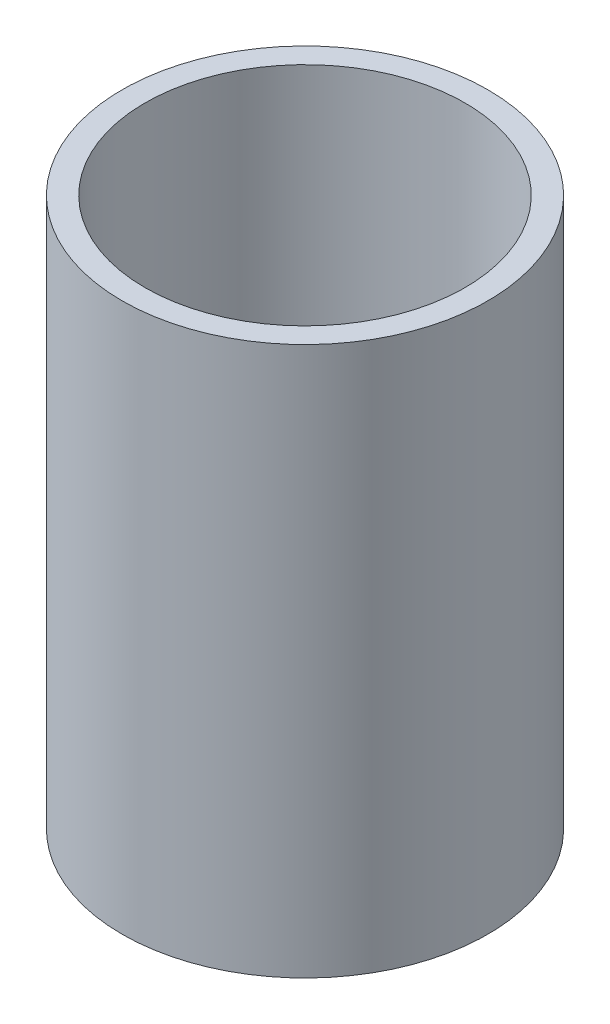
ISO-10303-21;
HEADER;
FILE_DESCRIPTION(('STEP AP214'),'2;1');
FILE_NAME('part.step','',(''),(''),'','','');
FILE_SCHEMA(('AUTOMOTIVE_DESIGN { 1 0 10303 214 1 1 1 1 }'));
ENDSEC;
DATA;
#1=APPLICATION_CONTEXT('core data for automotive mechanical design processes');
#2=APPLICATION_PROTOCOL_DEFINITION('international standard','automotive_design',2000,#1);
#3=PRODUCT_CONTEXT('',#1,'mechanical');
#4=PRODUCT('Part','Part','',(#3));
#5=PRODUCT_RELATED_PRODUCT_CATEGORY('part','',(#4));
#6=PRODUCT_DEFINITION_FORMATION('','',#4);
#7=PRODUCT_DEFINITION_CONTEXT('part definition',#1,'design');
#8=PRODUCT_DEFINITION('design','',#6,#7);
#9=PRODUCT_DEFINITION_SHAPE('','',#8);
#10=(LENGTH_UNIT() NAMED_UNIT(*) SI_UNIT(.MILLI.,.METRE.));
#11=(NAMED_UNIT(*) PLANE_ANGLE_UNIT() SI_UNIT($,.RADIAN.));
#12=(NAMED_UNIT(*) SI_UNIT($,.STERADIAN.) SOLID_ANGLE_UNIT());
#13=UNCERTAINTY_MEASURE_WITH_UNIT(LENGTH_MEASURE(1.E-05),#10,'distance_accuracy_value','');
#14=(GEOMETRIC_REPRESENTATION_CONTEXT(3) GLOBAL_UNCERTAINTY_ASSIGNED_CONTEXT((#13)) GLOBAL_UNIT_ASSIGNED_CONTEXT((#10,
#11,#12)) REPRESENTATION_CONTEXT('',''));
#15=CARTESIAN_POINT('',(0.,0.,0.));
#16=DIRECTION('',(0.,0.,1.));
#17=DIRECTION('',(1.,0.,0.));
#18=AXIS2_PLACEMENT_3D('',#15,#16,#17);
#19=CARTESIAN_POINT('',(0.,38.1,0.));
#20=DIRECTION('',(0.,-1.,0.));
#21=DIRECTION('',(0.,0.,-1.));
#22=AXIS2_PLACEMENT_3D('',#19,#20,#21);
#23=CYLINDRICAL_SURFACE('',#22,12.7);
#24=CARTESIAN_POINT('',(0.,38.1,0.));
#25=DIRECTION('',(0.,1.,0.));
#26=DIRECTION('',(0.,0.,1.));
#27=AXIS2_PLACEMENT_3D('',#24,#25,#26);
#28=CIRCLE('',#27,12.7);
#29=CARTESIAN_POINT('',(0.,38.1,-12.7));
#30=VERTEX_POINT('',#29);
#31=EDGE_CURVE('E10',#30,#30,#28,.T.);
#32=CARTESIAN_POINT('',(0.,0.,0.));
#33=DIRECTION('',(0.,1.,0.));
#34=DIRECTION('',(0.,0.,1.));
#35=AXIS2_PLACEMENT_3D('',#32,#33,#34);
#36=CIRCLE('',#35,12.7);
#37=CARTESIAN_POINT('',(0.,0.,-12.7));
#38=VERTEX_POINT('',#37);
#39=EDGE_CURVE('E32',#38,#38,#36,.T.);
#40=CARTESIAN_POINT('',(0.,38.1,-12.7));
#41=CARTESIAN_POINT('',(0.,37.703125,-12.7));
#42=CARTESIAN_POINT('',(0.,37.30625,-12.7));
#43=CARTESIAN_POINT('',(0.,36.5125,-12.7));
#44=CARTESIAN_POINT('',(0.,36.115625,-12.7));
#45=CARTESIAN_POINT('',(0.,35.321875,-12.7));
#46=CARTESIAN_POINT('',(0.,34.925,-12.7));
#47=CARTESIAN_POINT('',(0.,34.13125,-12.7));
#48=CARTESIAN_POINT('',(0.,33.734375,-12.7));
#49=CARTESIAN_POINT('',(0.,32.940625,-12.7));
#50=CARTESIAN_POINT('',(0.,32.54375,-12.7));
#51=CARTESIAN_POINT('',(0.,31.75,-12.7));
#52=CARTESIAN_POINT('',(0.,31.353125,-12.7));
#53=CARTESIAN_POINT('',(0.,30.559375,-12.7));
#54=CARTESIAN_POINT('',(0.,30.1625,-12.7));
#55=CARTESIAN_POINT('',(0.,29.36875,-12.7));
#56=CARTESIAN_POINT('',(0.,28.971875,-12.7));
#57=CARTESIAN_POINT('',(0.,28.178125,-12.7));
#58=CARTESIAN_POINT('',(0.,27.78125,-12.7));
#59=CARTESIAN_POINT('',(0.,26.9875,-12.7));
#60=CARTESIAN_POINT('',(0.,26.590625,-12.7));
#61=CARTESIAN_POINT('',(0.,25.796875,-12.7));
#62=CARTESIAN_POINT('',(0.,25.4,-12.7));
#63=CARTESIAN_POINT('',(0.,24.60625,-12.7));
#64=CARTESIAN_POINT('',(0.,24.209375,-12.7));
#65=CARTESIAN_POINT('',(0.,23.415625,-12.7));
#66=CARTESIAN_POINT('',(0.,23.01875,-12.7));
#67=CARTESIAN_POINT('',(0.,22.225,-12.7));
#68=CARTESIAN_POINT('',(0.,21.828125,-12.7));
#69=CARTESIAN_POINT('',(0.,21.034375,-12.7));
#70=CARTESIAN_POINT('',(0.,20.6375,-12.7));
#71=CARTESIAN_POINT('',(0.,19.84375,-12.7));
#72=CARTESIAN_POINT('',(0.,19.446875,-12.7));
#73=CARTESIAN_POINT('',(0.,18.653125,-12.7));
#74=CARTESIAN_POINT('',(0.,18.25625,-12.7));
#75=CARTESIAN_POINT('',(0.,17.4625,-12.7));
#76=CARTESIAN_POINT('',(0.,17.065625,-12.7));
#77=CARTESIAN_POINT('',(0.,16.271875,-12.7));
#78=CARTESIAN_POINT('',(0.,15.875,-12.7));
#79=CARTESIAN_POINT('',(0.,15.08125,-12.7));
#80=CARTESIAN_POINT('',(0.,14.684375,-12.7));
#81=CARTESIAN_POINT('',(0.,13.890625,-12.7));
#82=CARTESIAN_POINT('',(0.,13.49375,-12.7));
#83=CARTESIAN_POINT('',(0.,12.7,-12.7));
#84=CARTESIAN_POINT('',(0.,12.303125,-12.7));
#85=CARTESIAN_POINT('',(0.,11.509375,-12.7));
#86=CARTESIAN_POINT('',(0.,11.1125,-12.7));
#87=CARTESIAN_POINT('',(0.,10.31875,-12.7));
#88=CARTESIAN_POINT('',(0.,9.92187499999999,-12.7));
#89=CARTESIAN_POINT('',(0.,9.128125,-12.7));
#90=CARTESIAN_POINT('',(0.,8.73124999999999,-12.7));
#91=CARTESIAN_POINT('',(0.,7.93749999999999,-12.7));
#92=CARTESIAN_POINT('',(0.,7.54062499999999,-12.7));
#93=CARTESIAN_POINT('',(0.,6.746875,-12.7));
#94=CARTESIAN_POINT('',(0.,6.35,-12.7));
#95=CARTESIAN_POINT('',(0.,5.55625,-12.7));
#96=CARTESIAN_POINT('',(0.,5.159375,-12.7));
#97=CARTESIAN_POINT('',(0.,4.365625,-12.7));
#98=CARTESIAN_POINT('',(0.,3.96875,-12.7));
#99=CARTESIAN_POINT('',(0.,3.175,-12.7));
#100=CARTESIAN_POINT('',(0.,2.778125,-12.7));
#101=CARTESIAN_POINT('',(0.,1.984375,-12.7));
#102=CARTESIAN_POINT('',(0.,1.5875,-12.7));
#103=CARTESIAN_POINT('',(0.,0.79375,-12.7));
#104=CARTESIAN_POINT('',(0.,0.396875,-12.7));
#105=CARTESIAN_POINT('',(0.,0.,-12.7));
#106=B_SPLINE_CURVE_WITH_KNOTS('',3,(#40,#41,#42,#43,#44,#45,#46,#47,#48,#49,#50,#51,#52,#53,
#54,#55,#56,#57,#58,#59,#60,#61,#62,#63,#64,#65,#66,#67,#68,#69,#70,#71,#72,#73,#74,#75,#76,#77,
#78,#79,#80,#81,#82,#83,#84,#85,#86,#87,#88,#89,#90,#91,#92,#93,#94,#95,#96,#97,#98,#99,#100,
#101,#102,#103,#104,#105),.UNSPECIFIED.,.F.,.F.,(4,2,2,2,2,2,2,2,2,2,2,2,2,2,2,2,2,2,2,2,2,2,2,
2,2,2,2,2,2,2,2,2,4),(0.,1.190625,2.38125,3.571875,4.7625,5.953125,7.14375,8.334375,
9.52500000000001,10.715625,11.90625,13.096875,14.2875,15.478125,16.66875,17.859375,19.05,
20.240625,21.43125,22.621875,23.8125,25.003125,26.19375,27.384375,28.575,29.765625,30.95625,
32.146875,33.3375,34.528125,35.71875,36.909375,38.1),.UNSPECIFIED.);
#107=EDGE_CURVE('BSEAM29',#30,#38,#106,.T.);
#108=ORIENTED_EDGE('',*,*,#31,.F.);
#109=ORIENTED_EDGE('',*,*,#39,.T.);
#110=ORIENTED_EDGE('',*,*,#107,.T.);
#111=ORIENTED_EDGE('',*,*,#107,.F.);
#112=EDGE_LOOP('',(#108,#110,#109,#111));
#113=FACE_BOUND('',#112,.T.);
#114=ADVANCED_FACE('F29',(#113),#23,.T.);
#115=CARTESIAN_POINT('',(0.,38.1,0.));
#116=DIRECTION('',(0.,1.,0.));
#117=DIRECTION('',(0.,0.,1.));
#118=AXIS2_PLACEMENT_3D('',#115,#116,#117);
#119=PLANE('',#118);
#120=CARTESIAN_POINT('',(0.,38.1,0.));
#121=DIRECTION('',(0.,1.,0.));
#122=DIRECTION('',(0.,0.,1.));
#123=AXIS2_PLACEMENT_3D('',#120,#121,#122);
#124=CIRCLE('',#123,11.1125);
#125=CARTESIAN_POINT('',(0.,38.1,11.1125));
#126=VERTEX_POINT('',#125);
#127=EDGE_CURVE('E41',#126,#126,#124,.T.);
#128=ORIENTED_EDGE('',*,*,#127,.F.);
#129=EDGE_LOOP('',(#128));
#130=FACE_BOUND('',#129,.T.);
#131=ORIENTED_EDGE('',*,*,#31,.T.);
#132=EDGE_LOOP('',(#131));
#133=FACE_BOUND('',#132,.T.);
#134=ADVANCED_FACE('F56',(#130,#133),#119,.T.);
#135=CARTESIAN_POINT('',(0.,0.,0.));
#136=DIRECTION('',(0.,1.,0.));
#137=DIRECTION('',(0.,0.,1.));
#138=AXIS2_PLACEMENT_3D('',#135,#136,#137);
#139=PLANE('',#138);
#140=CARTESIAN_POINT('',(0.,0.,0.));
#141=DIRECTION('',(0.,1.,0.));
#142=DIRECTION('',(0.,0.,1.));
#143=AXIS2_PLACEMENT_3D('',#140,#141,#142);
#144=CIRCLE('',#143,11.1125);
#145=CARTESIAN_POINT('',(0.,0.,11.1125));
#146=VERTEX_POINT('',#145);
#147=EDGE_CURVE('E39',#146,#146,#144,.T.);
#148=ORIENTED_EDGE('',*,*,#147,.T.);
#149=EDGE_LOOP('',(#148));
#150=FACE_BOUND('',#149,.T.);
#151=ORIENTED_EDGE('',*,*,#39,.F.);
#152=EDGE_LOOP('',(#151));
#153=FACE_BOUND('',#152,.T.);
#154=ADVANCED_FACE('F47',(#150,#153),#139,.F.);
#155=CARTESIAN_POINT('',(0.,0.,0.));
#156=DIRECTION('',(0.,1.,0.));
#157=DIRECTION('',(0.,0.,1.));
#158=AXIS2_PLACEMENT_3D('',#155,#156,#157);
#159=CYLINDRICAL_SURFACE('',#158,11.1125);
#160=CARTESIAN_POINT('',(0.,0.,11.1125));
#161=CARTESIAN_POINT('',(0.,0.396875,11.1125));
#162=CARTESIAN_POINT('',(0.,0.79375,11.1125));
#163=CARTESIAN_POINT('',(0.,1.5875,11.1125));
#164=CARTESIAN_POINT('',(0.,1.984375,11.1125));
#165=CARTESIAN_POINT('',(0.,2.778125,11.1125));
#166=CARTESIAN_POINT('',(0.,3.175,11.1125));
#167=CARTESIAN_POINT('',(0.,3.96875,11.1125));
#168=CARTESIAN_POINT('',(0.,4.365625,11.1125));
#169=CARTESIAN_POINT('',(0.,5.159375,11.1125));
#170=CARTESIAN_POINT('',(0.,5.55625,11.1125));
#171=CARTESIAN_POINT('',(0.,6.35,11.1125));
#172=CARTESIAN_POINT('',(0.,6.746875,11.1125));
#173=CARTESIAN_POINT('',(0.,7.540625,11.1125));
#174=CARTESIAN_POINT('',(0.,7.9375,11.1125));
#175=CARTESIAN_POINT('',(0.,8.73125,11.1125));
#176=CARTESIAN_POINT('',(0.,9.128125,11.1125));
#177=CARTESIAN_POINT('',(0.,9.921875,11.1125));
#178=CARTESIAN_POINT('',(0.,10.31875,11.1125));
#179=CARTESIAN_POINT('',(0.,11.1125,11.1125));
#180=CARTESIAN_POINT('',(0.,11.509375,11.1125));
#181=CARTESIAN_POINT('',(0.,12.303125,11.1125));
#182=CARTESIAN_POINT('',(0.,12.7,11.1125));
#183=CARTESIAN_POINT('',(0.,13.49375,11.1125));
#184=CARTESIAN_POINT('',(0.,13.890625,11.1125));
#185=CARTESIAN_POINT('',(0.,14.684375,11.1125));
#186=CARTESIAN_POINT('',(0.,15.08125,11.1125));
#187=CARTESIAN_POINT('',(0.,15.875,11.1125));
#188=CARTESIAN_POINT('',(0.,16.271875,11.1125));
#189=CARTESIAN_POINT('',(0.,17.065625,11.1125));
#190=CARTESIAN_POINT('',(0.,17.4625,11.1125));
#191=CARTESIAN_POINT('',(0.,18.25625,11.1125));
#192=CARTESIAN_POINT('',(0.,18.653125,11.1125));
#193=CARTESIAN_POINT('',(0.,19.446875,11.1125));
#194=CARTESIAN_POINT('',(0.,19.84375,11.1125));
#195=CARTESIAN_POINT('',(0.,20.6375,11.1125));
#196=CARTESIAN_POINT('',(0.,21.034375,11.1125));
#197=CARTESIAN_POINT('',(0.,21.828125,11.1125));
#198=CARTESIAN_POINT('',(0.,22.225,11.1125));
#199=CARTESIAN_POINT('',(0.,23.01875,11.1125));
#200=CARTESIAN_POINT('',(0.,23.415625,11.1125));
#201=CARTESIAN_POINT('',(0.,24.209375,11.1125));
#202=CARTESIAN_POINT('',(0.,24.60625,11.1125));
#203=CARTESIAN_POINT('',(0.,25.4,11.1125));
#204=CARTESIAN_POINT('',(0.,25.796875,11.1125));
#205=CARTESIAN_POINT('',(0.,26.590625,11.1125));
#206=CARTESIAN_POINT('',(0.,26.9875,11.1125));
#207=CARTESIAN_POINT('',(0.,27.78125,11.1125));
#208=CARTESIAN_POINT('',(0.,28.178125,11.1125));
#209=CARTESIAN_POINT('',(0.,28.971875,11.1125));
#210=CARTESIAN_POINT('',(0.,29.36875,11.1125));
#211=CARTESIAN_POINT('',(0.,30.1625,11.1125));
#212=CARTESIAN_POINT('',(0.,30.559375,11.1125));
#213=CARTESIAN_POINT('',(0.,31.353125,11.1125));
#214=CARTESIAN_POINT('',(0.,31.75,11.1125));
#215=CARTESIAN_POINT('',(0.,32.54375,11.1125));
#216=CARTESIAN_POINT('',(0.,32.940625,11.1125));
#217=CARTESIAN_POINT('',(0.,33.734375,11.1125));
#218=CARTESIAN_POINT('',(0.,34.13125,11.1125));
#219=CARTESIAN_POINT('',(0.,34.925,11.1125));
#220=CARTESIAN_POINT('',(0.,35.321875,11.1125));
#221=CARTESIAN_POINT('',(0.,36.115625,11.1125));
#222=CARTESIAN_POINT('',(0.,36.5125,11.1125));
#223=CARTESIAN_POINT('',(0.,37.30625,11.1125));
#224=CARTESIAN_POINT('',(0.,37.703125,11.1125));
#225=CARTESIAN_POINT('',(0.,38.1,11.1125));
#226=B_SPLINE_CURVE_WITH_KNOTS('',3,(#160,#161,#162,#163,#164,#165,#166,#167,#168,#169,#170,
#171,#172,#173,#174,#175,#176,#177,#178,#179,#180,#181,#182,#183,#184,#185,#186,#187,#188,#189,
#190,#191,#192,#193,#194,#195,#196,#197,#198,#199,#200,#201,#202,#203,#204,#205,#206,#207,#208,
#209,#210,#211,#212,#213,#214,#215,#216,#217,#218,#219,#220,#221,#222,#223,#224,#225),
.UNSPECIFIED.,.F.,.F.,(4,2,2,2,2,2,2,2,2,2,2,2,2,2,2,2,2,2,2,2,2,2,2,2,2,2,2,2,2,2,2,2,4),(0.,
1.190625,2.38125,3.571875,4.7625,5.953125,7.14375,8.334375,9.525,10.715625,11.90625,13.096875,
14.2875,15.478125,16.66875,17.859375,19.05,20.240625,21.43125,22.621875,23.8125,25.003125,
26.19375,27.384375,28.575,29.765625,30.95625,32.146875,33.3375,34.528125,35.71875,36.909375,
38.1),.UNSPECIFIED.);
#227=EDGE_CURVE('BSEAM50',#146,#126,#226,.T.);
#228=ORIENTED_EDGE('',*,*,#147,.F.);
#229=ORIENTED_EDGE('',*,*,#127,.T.);
#230=ORIENTED_EDGE('',*,*,#227,.T.);
#231=ORIENTED_EDGE('',*,*,#227,.F.);
#232=EDGE_LOOP('',(#228,#230,#229,#231));
#233=FACE_BOUND('',#232,.T.);
#234=ADVANCED_FACE('F50',(#233),#159,.F.);
#235=CLOSED_SHELL('',(#114,#134,#154,#234));
#236=MANIFOLD_SOLID_BREP('B2',#235);
#237=ADVANCED_BREP_SHAPE_REPRESENTATION('',(#18,#236),#14);
#238=SHAPE_DEFINITION_REPRESENTATION(#9,#237);
ENDSEC;
END-ISO-10303-21;
